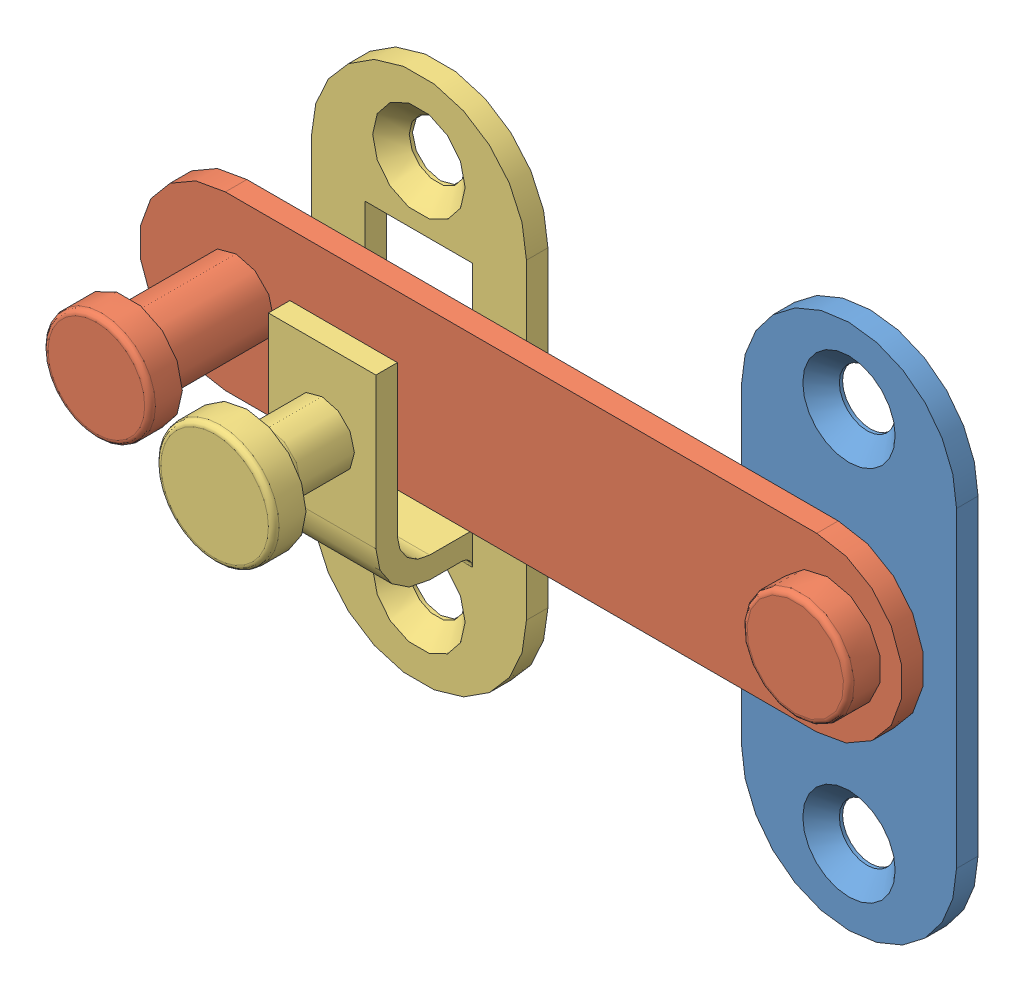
SolidWorks assembly J3UK.sldasm, configuration ﾃﾞﾌｫﾙﾄ (file format 12000). Lengths in mm.
Overall size (74 49 21).
3 component instances, 3 part files, 0 mates.
Components (placement in the parent):
- J3UK_a-1: J3UK_a.sldprt [ﾃﾞﾌｫﾙﾄ] at origin size (20 49 2)
- J3UK_handle-1: J3UK_handle.sldprt [ﾃﾞﾌｫﾙﾄ] at origin size (71 16 15)
- J3UK_b-1: J3UK_b.sldprt [ﾃﾞﾌｫﾙﾄ] at (-40 0 -2) size (20 49 21)
